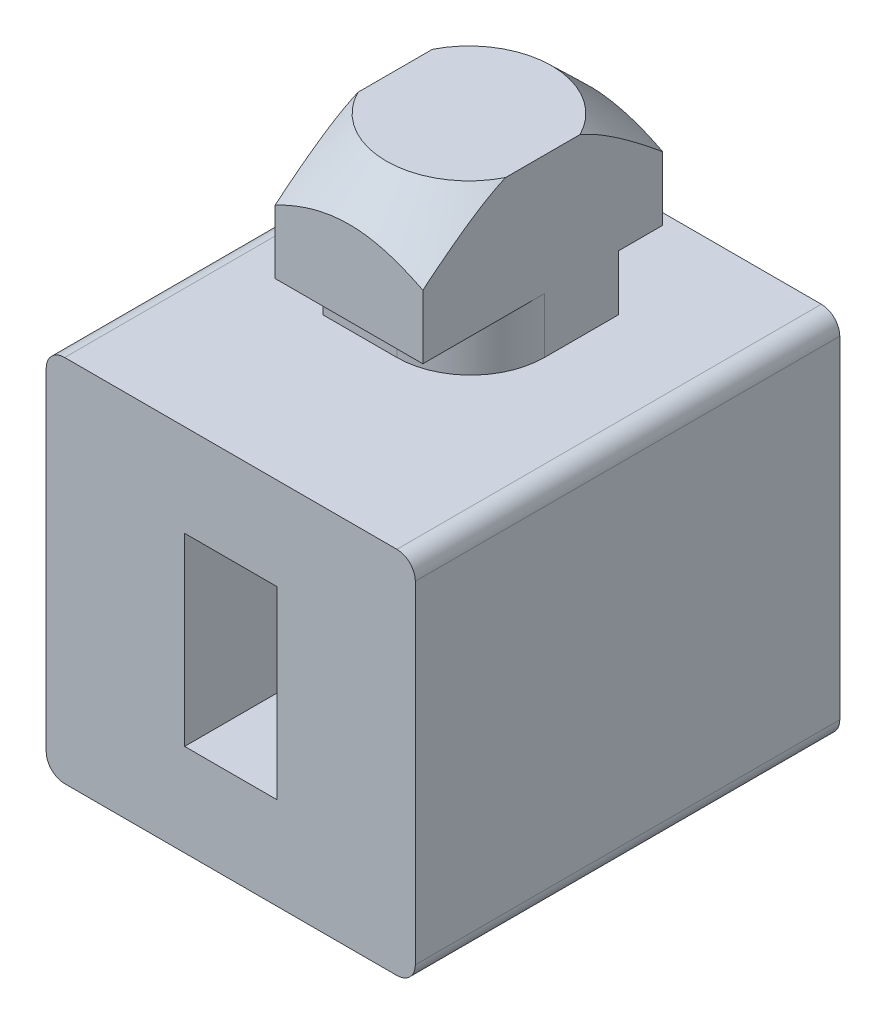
from build123d import *

# Parameters (mm, degrees)
SKETCH_1_W          = 20
SKETCH_1_H          = 20
EXTRUDE_1_DEPTH     = 11.5
EXTRUDE_2_DEPTH     = 3
SKETCH_3_W          = 8
SKETCH_3_H          = 13
EXTRUDE_3_DEPTH     = 6.5
SKETCH_5_W          = 5
SKETCH_5_H          = 10
CUT_EXTRUDE_1_DEPTH = 25
SKETCH_6_W          = 10
SKETCH_6_H          = 5
CUT_EXTRUDE_2_DEPTH = 15
FILLET_1_R          = 1


with BuildPart() as part:
    # Sketch 1 → Extrude 1 (new, symmetric)
    with BuildSketch(Plane.XY):
        Rectangle(SKETCH_1_W, SKETCH_1_H)
    extrude(amount=EXTRUDE_1_DEPTH, both=True)

    # Sketch 2 → Extrude 2 (add)
    with BuildSketch(Plane(origin=(0, 10, 0), x_dir=(1, 0, 0), z_dir=(0, 1, 0))):
        with BuildLine():
            Line((0, 5.5), (4, 5.5))
            Line((4, 5.5), (4, 1.5))
            ThreePointArc((4, 1.5), (2.828427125, -1.328427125), (0, -2.5))
            Line((0, -2.5), (-4, -2.5))
            Line((-4, -2.5), (-4, 1.5))
            ThreePointArc((-4, 1.5), (-2.828427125, 4.328427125), (0, 5.5))
        make_face()
    extrude(amount=EXTRUDE_2_DEPTH)

    # Sketch 3 → Extrude 3 (add)
    with BuildSketch(Plane(origin=(0, 13, 0), x_dir=(1, 0, 0), z_dir=(0, 1, 0))):
        with Locations((0, 1.407239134)):
            Rectangle(SKETCH_3_W, SKETCH_3_H)
    extrude(amount=EXTRUDE_3_DEPTH)

    # Sketch 5 → Cut-Extrude 1 (cut)
    with BuildSketch(Plane(origin=(0, 0, -11.5), x_dir=(-1, 0, 0), z_dir=(0, 0, -1))):
        Rectangle(SKETCH_5_W, SKETCH_5_H)
    extrude(amount=-CUT_EXTRUDE_1_DEPTH, mode=Mode.SUBTRACT)

    # Sketch 6 → Cut-Extrude 2 (cut)
    with BuildSketch(Plane.XZ.offset(10)):
        with Locations((0, -1.5)):
            Rectangle(SKETCH_6_W, SKETCH_6_H)
    extrude(amount=-CUT_EXTRUDE_2_DEPTH, mode=Mode.SUBTRACT)

    # Sweep 1: sweep along a path in Sketch 7
    with BuildLine(Plane(origin=(0, 19.5, 0), x_dir=(1, 0, 0), z_dir=(0, 1, 0))) as sweep_1_path:
        ThreePointArc((6.29913163, 3.010654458), (-6.482858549, 0.935492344), (6.464898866, 0.732640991))
    # Sketch 8 → Sweep 1 (sweep, cut)
    with BuildSketch(Plane(origin=(6.29913163, 19.5, -3.010654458), x_dir=(-0.9690971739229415, 0, 0.24667928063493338), z_dir=(-0.24667928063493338, 0, -0.9690971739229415))):
        Polygon((2.02019598, 0), (-1.182854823, 3.203050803), (-1.182854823, -3.093150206), align=None)
    sweep(path=sweep_1_path.line, mode=Mode.SUBTRACT)

    # Fillet 1
    fillet_1_edges = [part.edges().sort_by_distance(p)[0] for p in [
        (10, -10, 0),
        (-10, -10, 0),
        (-10, 10, 0),
        (10, 10, 0),
    ]]
    fillet(fillet_1_edges, radius=FILLET_1_R)


solid = part.part
